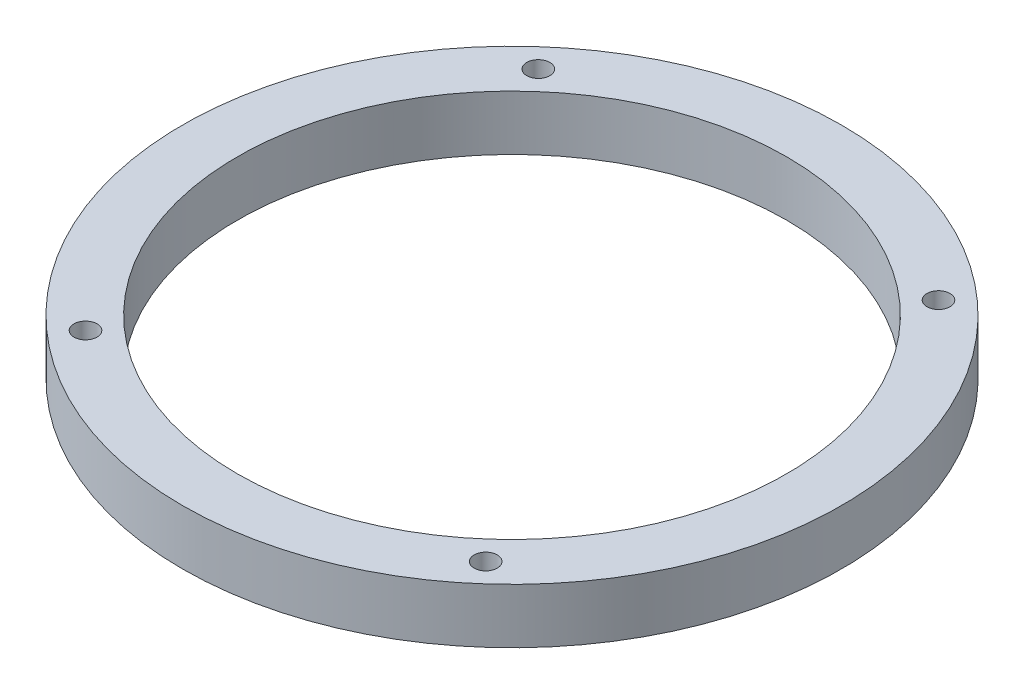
ISO-10303-21;
HEADER;
FILE_DESCRIPTION(('STEP AP214'),'2;1');
FILE_NAME('part.step','',(''),(''),'','','');
FILE_SCHEMA(('AUTOMOTIVE_DESIGN { 1 0 10303 214 1 1 1 1 }'));
ENDSEC;
DATA;
#1=APPLICATION_CONTEXT('core data for automotive mechanical design processes');
#2=APPLICATION_PROTOCOL_DEFINITION('international standard','automotive_design',2000,#1);
#3=PRODUCT_CONTEXT('',#1,'mechanical');
#4=PRODUCT('Part','Part','',(#3));
#5=PRODUCT_RELATED_PRODUCT_CATEGORY('part','',(#4));
#6=PRODUCT_DEFINITION_FORMATION('','',#4);
#7=PRODUCT_DEFINITION_CONTEXT('part definition',#1,'design');
#8=PRODUCT_DEFINITION('design','',#6,#7);
#9=PRODUCT_DEFINITION_SHAPE('','',#8);
#10=(LENGTH_UNIT() NAMED_UNIT(*) SI_UNIT(.MILLI.,.METRE.));
#11=(NAMED_UNIT(*) PLANE_ANGLE_UNIT() SI_UNIT($,.RADIAN.));
#12=(NAMED_UNIT(*) SI_UNIT($,.STERADIAN.) SOLID_ANGLE_UNIT());
#13=UNCERTAINTY_MEASURE_WITH_UNIT(LENGTH_MEASURE(1.E-05),#10,'distance_accuracy_value','');
#14=(GEOMETRIC_REPRESENTATION_CONTEXT(3) GLOBAL_UNCERTAINTY_ASSIGNED_CONTEXT((#13)) GLOBAL_UNIT_ASSIGNED_CONTEXT((#10,
#11,#12)) REPRESENTATION_CONTEXT('',''));
#15=CARTESIAN_POINT('',(0.,0.,0.));
#16=DIRECTION('',(0.,0.,1.));
#17=DIRECTION('',(1.,0.,0.));
#18=AXIS2_PLACEMENT_3D('',#15,#16,#17);
#19=CARTESIAN_POINT('',(0.,10.,0.));
#20=DIRECTION('',(0.,1.,0.));
#21=DIRECTION('',(0.,0.,1.));
#22=AXIS2_PLACEMENT_3D('',#19,#20,#21);
#23=PLANE('',#22);
#24=CARTESIAN_POINT('',(-36.4296575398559,10.,41.2180144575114));
#25=DIRECTION('',(0.,1.,0.));
#26=DIRECTION('',(0.,0.,1.));
#27=AXIS2_PLACEMENT_3D('',#24,#25,#26);
#28=CIRCLE('',#27,2.1);
#29=CARTESIAN_POINT('',(-36.4296575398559,10.,43.3180144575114));
#30=VERTEX_POINT('',#29);
#31=EDGE_CURVE('E59',#30,#30,#28,.T.);
#32=ORIENTED_EDGE('',*,*,#31,.F.);
#33=EDGE_LOOP('',(#32));
#34=FACE_BOUND('',#33,.T.);
#35=CARTESIAN_POINT('',(-36.4296575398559,10.,-41.2180144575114));
#36=DIRECTION('',(0.,1.,0.));
#37=DIRECTION('',(0.,0.,1.));
#38=AXIS2_PLACEMENT_3D('',#35,#36,#37);
#39=CIRCLE('',#38,2.1);
#40=CARTESIAN_POINT('',(-36.4296575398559,10.,-39.1180144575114));
#41=VERTEX_POINT('',#40);
#42=EDGE_CURVE('E47',#41,#41,#39,.T.);
#43=ORIENTED_EDGE('',*,*,#42,.F.);
#44=EDGE_LOOP('',(#43));
#45=FACE_BOUND('',#44,.T.);
#46=CARTESIAN_POINT('',(0.,10.,0.));
#47=DIRECTION('',(0.,1.,0.));
#48=DIRECTION('',(0.,0.,1.));
#49=AXIS2_PLACEMENT_3D('',#46,#47,#48);
#50=CIRCLE('',#49,60.);
#51=CARTESIAN_POINT('',(0.,10.,60.));
#52=VERTEX_POINT('',#51);
#53=EDGE_CURVE('E10',#52,#52,#50,.T.);
#54=ORIENTED_EDGE('',*,*,#53,.T.);
#55=EDGE_LOOP('',(#54));
#56=FACE_BOUND('',#55,.T.);
#57=CARTESIAN_POINT('',(0.,10.,0.));
#58=DIRECTION('',(0.,1.,0.));
#59=DIRECTION('',(0.,0.,1.));
#60=AXIS2_PLACEMENT_3D('',#57,#58,#59);
#61=CIRCLE('',#60,50.);
#62=CARTESIAN_POINT('',(0.,10.,50.));
#63=VERTEX_POINT('',#62);
#64=EDGE_CURVE('E42',#63,#63,#61,.T.);
#65=ORIENTED_EDGE('',*,*,#64,.F.);
#66=EDGE_LOOP('',(#65));
#67=FACE_BOUND('',#66,.T.);
#68=CARTESIAN_POINT('',(36.4296575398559,10.,-41.2180144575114));
#69=DIRECTION('',(0.,1.,0.));
#70=DIRECTION('',(0.,0.,1.));
#71=AXIS2_PLACEMENT_3D('',#68,#69,#70);
#72=CIRCLE('',#71,2.1);
#73=CARTESIAN_POINT('',(36.4296575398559,10.,-39.1180144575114));
#74=VERTEX_POINT('',#73);
#75=EDGE_CURVE('E53',#74,#74,#72,.T.);
#76=ORIENTED_EDGE('',*,*,#75,.F.);
#77=EDGE_LOOP('',(#76));
#78=FACE_BOUND('',#77,.T.);
#79=CARTESIAN_POINT('',(36.4296575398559,10.,41.2180144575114));
#80=DIRECTION('',(0.,1.,0.));
#81=DIRECTION('',(0.,0.,1.));
#82=AXIS2_PLACEMENT_3D('',#79,#80,#81);
#83=CIRCLE('',#82,2.1);
#84=CARTESIAN_POINT('',(36.4296575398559,10.,43.3180144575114));
#85=VERTEX_POINT('',#84);
#86=EDGE_CURVE('E65',#85,#85,#83,.T.);
#87=ORIENTED_EDGE('',*,*,#86,.F.);
#88=EDGE_LOOP('',(#87));
#89=FACE_BOUND('',#88,.T.);
#90=ADVANCED_FACE('F31',(#34,#45,#56,#67,#78,#89),#23,.T.);
#91=CARTESIAN_POINT('',(0.,0.,0.));
#92=DIRECTION('',(0.,1.,0.));
#93=DIRECTION('',(0.,0.,1.));
#94=AXIS2_PLACEMENT_3D('',#91,#92,#93);
#95=PLANE('',#94);
#96=CARTESIAN_POINT('',(-36.4296575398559,0.,41.2180144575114));
#97=DIRECTION('',(0.,1.,0.));
#98=DIRECTION('',(0.,0.,1.));
#99=AXIS2_PLACEMENT_3D('',#96,#97,#98);
#100=CIRCLE('',#99,2.1);
#101=CARTESIAN_POINT('',(-36.4296575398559,0.,43.3180144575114));
#102=VERTEX_POINT('',#101);
#103=EDGE_CURVE('E62',#102,#102,#100,.T.);
#104=ORIENTED_EDGE('',*,*,#103,.T.);
#105=EDGE_LOOP('',(#104));
#106=FACE_BOUND('',#105,.T.);
#107=CARTESIAN_POINT('',(-36.4296575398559,0.,-41.2180144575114));
#108=DIRECTION('',(0.,1.,0.));
#109=DIRECTION('',(0.,0.,1.));
#110=AXIS2_PLACEMENT_3D('',#107,#108,#109);
#111=CIRCLE('',#110,2.1);
#112=CARTESIAN_POINT('',(-36.4296575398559,0.,-39.1180144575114));
#113=VERTEX_POINT('',#112);
#114=EDGE_CURVE('E50',#113,#113,#111,.T.);
#115=ORIENTED_EDGE('',*,*,#114,.T.);
#116=EDGE_LOOP('',(#115));
#117=FACE_BOUND('',#116,.T.);
#118=CARTESIAN_POINT('',(0.,0.,0.));
#119=DIRECTION('',(0.,1.,0.));
#120=DIRECTION('',(0.,0.,1.));
#121=AXIS2_PLACEMENT_3D('',#118,#119,#120);
#122=CIRCLE('',#121,60.);
#123=CARTESIAN_POINT('',(0.,0.,60.));
#124=VERTEX_POINT('',#123);
#125=EDGE_CURVE('E35',#124,#124,#122,.T.);
#126=ORIENTED_EDGE('',*,*,#125,.F.);
#127=EDGE_LOOP('',(#126));
#128=FACE_BOUND('',#127,.T.);
#129=CARTESIAN_POINT('',(0.,0.,0.));
#130=DIRECTION('',(0.,1.,0.));
#131=DIRECTION('',(0.,0.,1.));
#132=AXIS2_PLACEMENT_3D('',#129,#130,#131);
#133=CIRCLE('',#132,50.);
#134=CARTESIAN_POINT('',(0.,0.,50.));
#135=VERTEX_POINT('',#134);
#136=EDGE_CURVE('E44',#135,#135,#133,.T.);
#137=ORIENTED_EDGE('',*,*,#136,.T.);
#138=EDGE_LOOP('',(#137));
#139=FACE_BOUND('',#138,.T.);
#140=CARTESIAN_POINT('',(36.4296575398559,0.,-41.2180144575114));
#141=DIRECTION('',(0.,1.,0.));
#142=DIRECTION('',(0.,0.,1.));
#143=AXIS2_PLACEMENT_3D('',#140,#141,#142);
#144=CIRCLE('',#143,2.1);
#145=CARTESIAN_POINT('',(36.4296575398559,0.,-39.1180144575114));
#146=VERTEX_POINT('',#145);
#147=EDGE_CURVE('E56',#146,#146,#144,.T.);
#148=ORIENTED_EDGE('',*,*,#147,.T.);
#149=EDGE_LOOP('',(#148));
#150=FACE_BOUND('',#149,.T.);
#151=CARTESIAN_POINT('',(36.4296575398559,0.,41.2180144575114));
#152=DIRECTION('',(0.,1.,0.));
#153=DIRECTION('',(0.,0.,1.));
#154=AXIS2_PLACEMENT_3D('',#151,#152,#153);
#155=CIRCLE('',#154,2.1);
#156=CARTESIAN_POINT('',(36.4296575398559,0.,43.3180144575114));
#157=VERTEX_POINT('',#156);
#158=EDGE_CURVE('E68',#157,#157,#155,.T.);
#159=ORIENTED_EDGE('',*,*,#158,.T.);
#160=EDGE_LOOP('',(#159));
#161=FACE_BOUND('',#160,.T.);
#162=ADVANCED_FACE('F78',(#106,#117,#128,#139,#150,#161),#95,.F.);
#163=CARTESIAN_POINT('',(0.,10.,0.));
#164=DIRECTION('',(0.,-1.,0.));
#165=DIRECTION('',(0.,0.,-1.));
#166=AXIS2_PLACEMENT_3D('',#163,#164,#165);
#167=CYLINDRICAL_SURFACE('',#166,60.);
#168=ORIENTED_EDGE('',*,*,#53,.F.);
#169=EDGE_LOOP('',(#168));
#170=FACE_BOUND('',#169,.T.);
#171=ORIENTED_EDGE('',*,*,#125,.T.);
#172=EDGE_LOOP('',(#171));
#173=FACE_BOUND('',#172,.T.);
#174=ADVANCED_FACE('F33',(#170,#173),#167,.T.);
#175=CARTESIAN_POINT('',(0.,10.,0.));
#176=DIRECTION('',(0.,-1.,0.));
#177=DIRECTION('',(0.,0.,-1.));
#178=AXIS2_PLACEMENT_3D('',#175,#176,#177);
#179=CYLINDRICAL_SURFACE('',#178,50.);
#180=ORIENTED_EDGE('',*,*,#64,.T.);
#181=EDGE_LOOP('',(#180));
#182=FACE_BOUND('',#181,.T.);
#183=ORIENTED_EDGE('',*,*,#136,.F.);
#184=EDGE_LOOP('',(#183));
#185=FACE_BOUND('',#184,.T.);
#186=ADVANCED_FACE('F88',(#182,#185),#179,.F.);
#187=CARTESIAN_POINT('',(-36.4296575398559,10.,-41.2180144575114));
#188=DIRECTION('',(0.,-1.,0.));
#189=DIRECTION('',(0.,0.,-1.));
#190=AXIS2_PLACEMENT_3D('',#187,#188,#189);
#191=CYLINDRICAL_SURFACE('',#190,2.1);
#192=ORIENTED_EDGE('',*,*,#42,.T.);
#193=EDGE_LOOP('',(#192));
#194=FACE_BOUND('',#193,.T.);
#195=ORIENTED_EDGE('',*,*,#114,.F.);
#196=EDGE_LOOP('',(#195));
#197=FACE_BOUND('',#196,.T.);
#198=ADVANCED_FACE('F91',(#194,#197),#191,.F.);
#199=CARTESIAN_POINT('',(36.4296575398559,10.,-41.2180144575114));
#200=DIRECTION('',(0.,-1.,0.));
#201=DIRECTION('',(0.,0.,-1.));
#202=AXIS2_PLACEMENT_3D('',#199,#200,#201);
#203=CYLINDRICAL_SURFACE('',#202,2.1);
#204=ORIENTED_EDGE('',*,*,#75,.T.);
#205=EDGE_LOOP('',(#204));
#206=FACE_BOUND('',#205,.T.);
#207=ORIENTED_EDGE('',*,*,#147,.F.);
#208=EDGE_LOOP('',(#207));
#209=FACE_BOUND('',#208,.T.);
#210=ADVANCED_FACE('F95',(#206,#209),#203,.F.);
#211=CARTESIAN_POINT('',(-36.4296575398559,10.,41.2180144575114));
#212=DIRECTION('',(0.,-1.,0.));
#213=DIRECTION('',(0.,0.,-1.));
#214=AXIS2_PLACEMENT_3D('',#211,#212,#213);
#215=CYLINDRICAL_SURFACE('',#214,2.1);
#216=ORIENTED_EDGE('',*,*,#31,.T.);
#217=EDGE_LOOP('',(#216));
#218=FACE_BOUND('',#217,.T.);
#219=ORIENTED_EDGE('',*,*,#103,.F.);
#220=EDGE_LOOP('',(#219));
#221=FACE_BOUND('',#220,.T.);
#222=ADVANCED_FACE('F99',(#218,#221),#215,.F.);
#223=CARTESIAN_POINT('',(36.4296575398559,10.,41.2180144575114));
#224=DIRECTION('',(0.,-1.,0.));
#225=DIRECTION('',(0.,0.,-1.));
#226=AXIS2_PLACEMENT_3D('',#223,#224,#225);
#227=CYLINDRICAL_SURFACE('',#226,2.1);
#228=ORIENTED_EDGE('',*,*,#86,.T.);
#229=EDGE_LOOP('',(#228));
#230=FACE_BOUND('',#229,.T.);
#231=ORIENTED_EDGE('',*,*,#158,.F.);
#232=EDGE_LOOP('',(#231));
#233=FACE_BOUND('',#232,.T.);
#234=ADVANCED_FACE('F74',(#230,#233),#227,.F.);
#235=CLOSED_SHELL('',(#90,#162,#174,#186,#198,#210,#222,#234));
#236=MANIFOLD_SOLID_BREP('B2',#235);
#237=ADVANCED_BREP_SHAPE_REPRESENTATION('',(#18,#236),#14);
#238=SHAPE_DEFINITION_REPRESENTATION(#9,#237);
ENDSEC;
END-ISO-10303-21;
